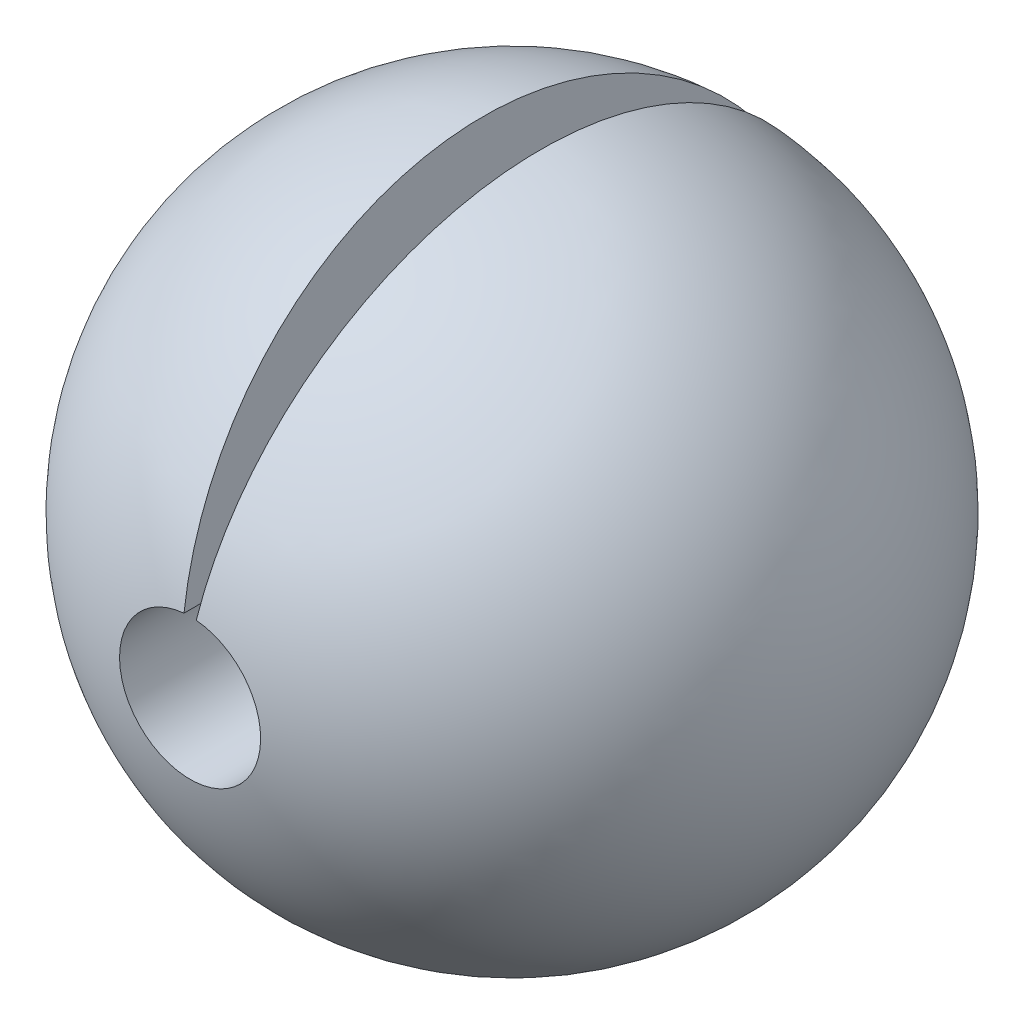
ISO-10303-21;
HEADER;
FILE_DESCRIPTION(('STEP AP214'),'2;1');
FILE_NAME('part.step','',(''),(''),'','','');
FILE_SCHEMA(('AUTOMOTIVE_DESIGN { 1 0 10303 214 1 1 1 1 }'));
ENDSEC;
DATA;
#1=APPLICATION_CONTEXT('core data for automotive mechanical design processes');
#2=APPLICATION_PROTOCOL_DEFINITION('international standard','automotive_design',2000,#1);
#3=PRODUCT_CONTEXT('',#1,'mechanical');
#4=PRODUCT('Part','Part','',(#3));
#5=PRODUCT_RELATED_PRODUCT_CATEGORY('part','',(#4));
#6=PRODUCT_DEFINITION_FORMATION('','',#4);
#7=PRODUCT_DEFINITION_CONTEXT('part definition',#1,'design');
#8=PRODUCT_DEFINITION('design','',#6,#7);
#9=PRODUCT_DEFINITION_SHAPE('','',#8);
#10=(LENGTH_UNIT() NAMED_UNIT(*) SI_UNIT(.MILLI.,.METRE.));
#11=(NAMED_UNIT(*) PLANE_ANGLE_UNIT() SI_UNIT($,.RADIAN.));
#12=(NAMED_UNIT(*) SI_UNIT($,.STERADIAN.) SOLID_ANGLE_UNIT());
#13=UNCERTAINTY_MEASURE_WITH_UNIT(LENGTH_MEASURE(1.E-05),#10,'distance_accuracy_value','');
#14=(GEOMETRIC_REPRESENTATION_CONTEXT(3) GLOBAL_UNCERTAINTY_ASSIGNED_CONTEXT((#13)) GLOBAL_UNIT_ASSIGNED_CONTEXT((#10,
#11,#12)) REPRESENTATION_CONTEXT('',''));
#15=CARTESIAN_POINT('',(0.,0.,0.));
#16=DIRECTION('',(0.,0.,1.));
#17=DIRECTION('',(1.,0.,0.));
#18=AXIS2_PLACEMENT_3D('',#15,#16,#17);
#19=CARTESIAN_POINT('',(0.,0.,0.));
#20=DIRECTION('',(0.,0.,1.));
#21=DIRECTION('',(-1.,0.,0.));
#22=AXIS2_PLACEMENT_3D('',#19,#20,#21);
#23=SPHERICAL_SURFACE('',#22,943.868634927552);
#24=CARTESIAN_POINT('',(0.,0.,-922.));
#25=DIRECTION('',(0.,0.,1.));
#26=DIRECTION('',(1.,0.,0.));
#27=AXIS2_PLACEMENT_3D('',#24,#25,#26);
#28=CIRCLE('',#27,202.);
#29=CARTESIAN_POINT('',(-17.605460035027,201.231329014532,-922.));
#30=VERTEX_POINT('',#29);
#31=CARTESIAN_POINT('',(17.605460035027,201.231329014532,-922.));
#32=VERTEX_POINT('',#31);
#33=EDGE_CURVE('E67',#30,#32,#28,.T.);
#34=ORIENTED_EDGE('',*,*,#33,.T.);
#35=CARTESIAN_POINT('',(0.,0.,0.));
#36=DIRECTION('',(0.996194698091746,-0.0871557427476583,0.));
#37=DIRECTION('',(0.0871557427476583,0.996194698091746,0.));
#38=AXIS2_PLACEMENT_3D('',#35,#36,#37);
#39=CIRCLE('',#38,943.868634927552);
#40=CARTESIAN_POINT('',(17.605460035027,201.231329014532,922.));
#41=VERTEX_POINT('',#40);
#42=EDGE_CURVE('E55',#32,#41,#39,.T.);
#43=ORIENTED_EDGE('',*,*,#42,.T.);
#44=CARTESIAN_POINT('',(0.,0.,922.));
#45=DIRECTION('',(0.,0.,1.));
#46=DIRECTION('',(1.,0.,0.));
#47=AXIS2_PLACEMENT_3D('',#44,#45,#46);
#48=CIRCLE('',#47,202.);
#49=CARTESIAN_POINT('',(-17.605460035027,201.231329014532,922.));
#50=VERTEX_POINT('',#49);
#51=EDGE_CURVE('E66',#50,#41,#48,.T.);
#52=ORIENTED_EDGE('',*,*,#51,.F.);
#53=CARTESIAN_POINT('',(0.,0.,0.));
#54=DIRECTION('',(-0.996194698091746,-0.0871557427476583,0.));
#55=DIRECTION('',(0.0871557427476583,-0.996194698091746,0.));
#56=AXIS2_PLACEMENT_3D('',#53,#54,#55);
#57=CIRCLE('',#56,943.868634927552);
#58=EDGE_CURVE('E48',#50,#30,#57,.T.);
#59=ORIENTED_EDGE('',*,*,#58,.T.);
#60=EDGE_LOOP('',(#34,#43,#52,#59));
#61=FACE_BOUND('',#60,.T.);
#62=ADVANCED_FACE('F35',(#61),#23,.T.);
#63=CARTESIAN_POINT('',(0.,0.,0.));
#64=DIRECTION('',(0.,0.,1.));
#65=DIRECTION('',(1.,0.,0.));
#66=AXIS2_PLACEMENT_3D('',#63,#64,#65);
#67=CYLINDRICAL_SURFACE('',#66,202.);
#68=ORIENTED_EDGE('',*,*,#51,.T.);
#69=DIRECTION('',(0.,0.,1.));
#70=VECTOR('',#69,1.);
#71=CARTESIAN_POINT('',(17.605460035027,201.231329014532,0.));
#72=LINE('',#71,#70);
#73=EDGE_CURVE('E11',#41,#32,#72,.F.);
#74=ORIENTED_EDGE('',*,*,#73,.T.);
#75=ORIENTED_EDGE('',*,*,#33,.F.);
#76=DIRECTION('',(0.,0.,1.));
#77=VECTOR('',#76,1.);
#78=CARTESIAN_POINT('',(-17.605460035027,201.231329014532,0.));
#79=LINE('',#78,#77);
#80=EDGE_CURVE('E42',#30,#50,#79,.T.);
#81=ORIENTED_EDGE('',*,*,#80,.T.);
#82=EDGE_LOOP('',(#68,#74,#75,#81));
#83=FACE_BOUND('',#82,.T.);
#84=ADVANCED_FACE('F69',(#83),#67,.F.);
#85=CARTESIAN_POINT('',(0.,0.,-922.));
#86=DIRECTION('',(-0.996194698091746,-0.0871557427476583,0.));
#87=DIRECTION('',(0.0871557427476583,-0.996194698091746,0.));
#88=AXIS2_PLACEMENT_3D('',#85,#86,#87);
#89=PLANE('',#88);
#90=ORIENTED_EDGE('',*,*,#80,.F.);
#91=ORIENTED_EDGE('',*,*,#58,.F.);
#92=EDGE_LOOP('',(#90,#91));
#93=FACE_BOUND('',#92,.T.);
#94=ADVANCED_FACE('F73',(#93),#89,.F.);
#95=CARTESIAN_POINT('',(88.8346636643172,1015.38485198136,-922.));
#96=DIRECTION('',(0.996194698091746,-0.0871557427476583,0.));
#97=DIRECTION('',(0.0871557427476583,0.996194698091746,0.));
#98=AXIS2_PLACEMENT_3D('',#95,#96,#97);
#99=PLANE('',#98);
#100=ORIENTED_EDGE('',*,*,#73,.F.);
#101=ORIENTED_EDGE('',*,*,#42,.F.);
#102=EDGE_LOOP('',(#100,#101));
#103=FACE_BOUND('',#102,.T.);
#104=ADVANCED_FACE('F59',(#103),#99,.F.);
#105=CLOSED_SHELL('',(#62,#84,#94,#104));
#106=MANIFOLD_SOLID_BREP('B2',#105);
#107=ADVANCED_BREP_SHAPE_REPRESENTATION('',(#18,#106),#14);
#108=SHAPE_DEFINITION_REPRESENTATION(#9,#107);
ENDSEC;
END-ISO-10303-21;
